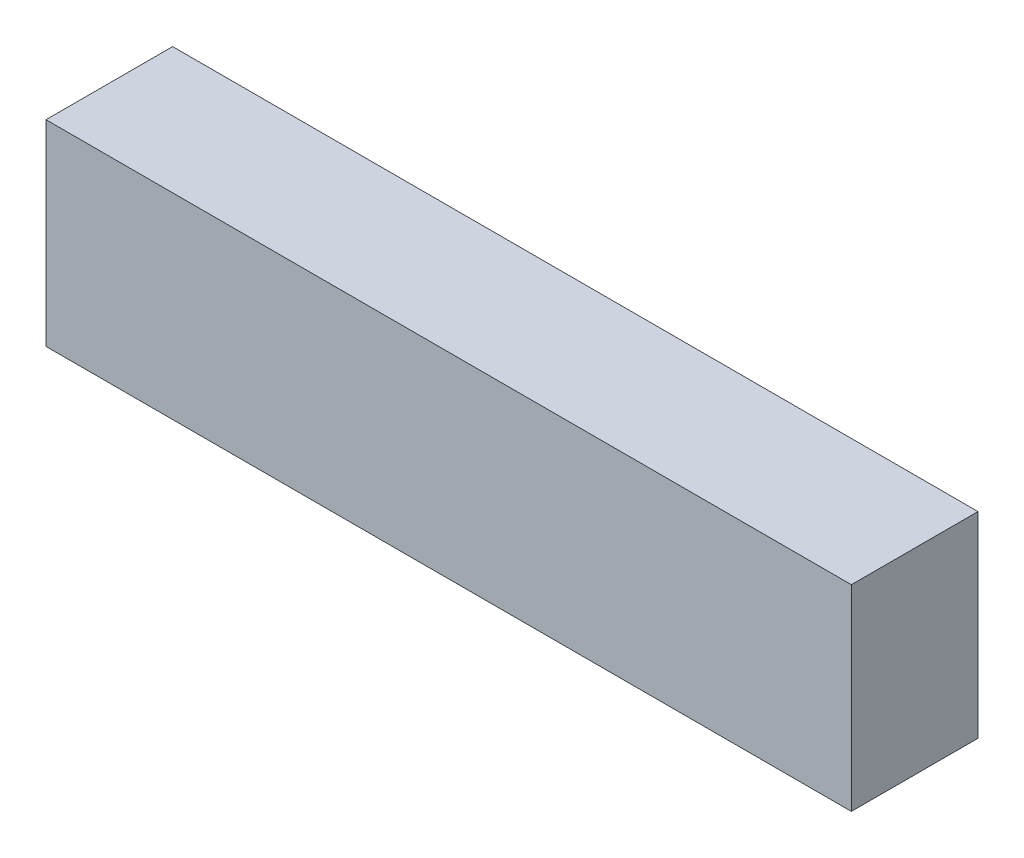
ISO-10303-21;
HEADER;
FILE_DESCRIPTION(('STEP AP214'),'2;1');
FILE_NAME('part.step','',(''),(''),'','','');
FILE_SCHEMA(('AUTOMOTIVE_DESIGN { 1 0 10303 214 1 1 1 1 }'));
ENDSEC;
DATA;
#1=APPLICATION_CONTEXT('core data for automotive mechanical design processes');
#2=APPLICATION_PROTOCOL_DEFINITION('international standard','automotive_design',2000,#1);
#3=PRODUCT_CONTEXT('',#1,'mechanical');
#4=PRODUCT('Part','Part','',(#3));
#5=PRODUCT_RELATED_PRODUCT_CATEGORY('part','',(#4));
#6=PRODUCT_DEFINITION_FORMATION('','',#4);
#7=PRODUCT_DEFINITION_CONTEXT('part definition',#1,'design');
#8=PRODUCT_DEFINITION('design','',#6,#7);
#9=PRODUCT_DEFINITION_SHAPE('','',#8);
#10=(LENGTH_UNIT() NAMED_UNIT(*) SI_UNIT(.MILLI.,.METRE.));
#11=(NAMED_UNIT(*) PLANE_ANGLE_UNIT() SI_UNIT($,.RADIAN.));
#12=(NAMED_UNIT(*) SI_UNIT($,.STERADIAN.) SOLID_ANGLE_UNIT());
#13=UNCERTAINTY_MEASURE_WITH_UNIT(LENGTH_MEASURE(1.E-05),#10,'distance_accuracy_value','');
#14=(GEOMETRIC_REPRESENTATION_CONTEXT(3) GLOBAL_UNCERTAINTY_ASSIGNED_CONTEXT((#13)) GLOBAL_UNIT_ASSIGNED_CONTEXT((#10,
#11,#12)) REPRESENTATION_CONTEXT('',''));
#15=CARTESIAN_POINT('',(0.,0.,0.));
#16=DIRECTION('',(0.,0.,1.));
#17=DIRECTION('',(1.,0.,0.));
#18=AXIS2_PLACEMENT_3D('',#15,#16,#17);
#19=CARTESIAN_POINT('',(30.,65.5056179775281,10.));
#20=DIRECTION('',(1.,0.,0.));
#21=DIRECTION('',(0.,1.,0.));
#22=AXIS2_PLACEMENT_3D('',#19,#20,#21);
#23=PLANE('',#22);
#24=DIRECTION('',(0.,-1.,0.));
#25=VECTOR('',#24,1.);
#26=CARTESIAN_POINT('',(30.,65.5056179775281,0.));
#27=LINE('',#26,#25);
#28=CARTESIAN_POINT('',(30.,65.5056179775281,0.));
#29=VERTEX_POINT('',#28);
#30=CARTESIAN_POINT('',(30.,50.,0.));
#31=VERTEX_POINT('',#30);
#32=EDGE_CURVE('E96',#29,#31,#27,.T.);
#33=ORIENTED_EDGE('',*,*,#32,.T.);
#34=DIRECTION('',(0.,0.,-1.));
#35=VECTOR('',#34,1.);
#36=CARTESIAN_POINT('',(30.,50.,10.));
#37=LINE('',#36,#35);
#38=CARTESIAN_POINT('',(30.,50.,10.));
#39=VERTEX_POINT('',#38);
#40=EDGE_CURVE('E11',#39,#31,#37,.T.);
#41=ORIENTED_EDGE('',*,*,#40,.F.);
#42=DIRECTION('',(0.,-1.,0.));
#43=VECTOR('',#42,1.);
#44=CARTESIAN_POINT('',(30.,65.5056179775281,10.));
#45=LINE('',#44,#43);
#46=CARTESIAN_POINT('',(30.,65.5056179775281,10.));
#47=VERTEX_POINT('',#46);
#48=EDGE_CURVE('E84',#47,#39,#45,.T.);
#49=ORIENTED_EDGE('',*,*,#48,.F.);
#50=DIRECTION('',(0.,0.,-1.));
#51=VECTOR('',#50,1.);
#52=CARTESIAN_POINT('',(30.,65.5056179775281,10.));
#53=LINE('',#52,#51);
#54=EDGE_CURVE('E92',#47,#29,#53,.T.);
#55=ORIENTED_EDGE('',*,*,#54,.T.);
#56=EDGE_LOOP('',(#33,#41,#49,#55));
#57=FACE_BOUND('',#56,.T.);
#58=ADVANCED_FACE('F33',(#57),#23,.F.);
#59=CARTESIAN_POINT('',(30.,50.,10.));
#60=DIRECTION('',(0.,1.,0.));
#61=DIRECTION('',(0.,0.,1.));
#62=AXIS2_PLACEMENT_3D('',#59,#60,#61);
#63=PLANE('',#62);
#64=DIRECTION('',(1.,0.,0.));
#65=VECTOR('',#64,1.);
#66=CARTESIAN_POINT('',(30.,50.,0.));
#67=LINE('',#66,#65);
#68=CARTESIAN_POINT('',(93.5955056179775,50.,0.));
#69=VERTEX_POINT('',#68);
#70=EDGE_CURVE('E88',#31,#69,#67,.T.);
#71=ORIENTED_EDGE('',*,*,#70,.T.);
#72=DIRECTION('',(0.,0.,-1.));
#73=VECTOR('',#72,1.);
#74=CARTESIAN_POINT('',(93.5955056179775,50.,10.));
#75=LINE('',#74,#73);
#76=CARTESIAN_POINT('',(93.5955056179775,50.,10.));
#77=VERTEX_POINT('',#76);
#78=EDGE_CURVE('E41',#77,#69,#75,.T.);
#79=ORIENTED_EDGE('',*,*,#78,.F.);
#80=DIRECTION('',(1.,0.,0.));
#81=VECTOR('',#80,1.);
#82=CARTESIAN_POINT('',(30.,50.,10.));
#83=LINE('',#82,#81);
#84=EDGE_CURVE('E79',#39,#77,#83,.T.);
#85=ORIENTED_EDGE('',*,*,#84,.F.);
#86=ORIENTED_EDGE('',*,*,#40,.T.);
#87=EDGE_LOOP('',(#71,#79,#85,#86));
#88=FACE_BOUND('',#87,.T.);
#89=ADVANCED_FACE('F87',(#88),#63,.F.);
#90=CARTESIAN_POINT('',(93.5955056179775,65.5056179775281,10.));
#91=DIRECTION('',(-1.,0.,0.));
#92=DIRECTION('',(0.,0.,1.));
#93=AXIS2_PLACEMENT_3D('',#90,#91,#92);
#94=PLANE('',#93);
#95=DIRECTION('',(0.,1.,0.));
#96=VECTOR('',#95,1.);
#97=CARTESIAN_POINT('',(93.5955056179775,65.5056179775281,0.));
#98=LINE('',#97,#96);
#99=CARTESIAN_POINT('',(93.5955056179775,65.5056179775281,0.));
#100=VERTEX_POINT('',#99);
#101=EDGE_CURVE('E66',#69,#100,#98,.T.);
#102=ORIENTED_EDGE('',*,*,#101,.T.);
#103=DIRECTION('',(0.,0.,-1.));
#104=VECTOR('',#103,1.);
#105=CARTESIAN_POINT('',(93.5955056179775,65.5056179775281,10.));
#106=LINE('',#105,#104);
#107=CARTESIAN_POINT('',(93.5955056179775,65.5056179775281,10.));
#108=VERTEX_POINT('',#107);
#109=EDGE_CURVE('E89',#108,#100,#106,.T.);
#110=ORIENTED_EDGE('',*,*,#109,.F.);
#111=DIRECTION('',(0.,1.,0.));
#112=VECTOR('',#111,1.);
#113=CARTESIAN_POINT('',(93.5955056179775,65.5056179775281,10.));
#114=LINE('',#113,#112);
#115=EDGE_CURVE('E82',#77,#108,#114,.T.);
#116=ORIENTED_EDGE('',*,*,#115,.F.);
#117=ORIENTED_EDGE('',*,*,#78,.T.);
#118=EDGE_LOOP('',(#102,#110,#116,#117));
#119=FACE_BOUND('',#118,.T.);
#120=ADVANCED_FACE('F90',(#119),#94,.F.);
#121=CARTESIAN_POINT('',(30.,65.5056179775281,10.));
#122=DIRECTION('',(0.,-1.,0.));
#123=DIRECTION('',(0.,0.,-1.));
#124=AXIS2_PLACEMENT_3D('',#121,#122,#123);
#125=PLANE('',#124);
#126=DIRECTION('',(-1.,0.,0.));
#127=VECTOR('',#126,1.);
#128=CARTESIAN_POINT('',(30.,65.5056179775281,0.));
#129=LINE('',#128,#127);
#130=EDGE_CURVE('E72',#100,#29,#129,.T.);
#131=ORIENTED_EDGE('',*,*,#130,.T.);
#132=ORIENTED_EDGE('',*,*,#54,.F.);
#133=DIRECTION('',(-1.,0.,0.));
#134=VECTOR('',#133,1.);
#135=CARTESIAN_POINT('',(30.,65.5056179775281,10.));
#136=LINE('',#135,#134);
#137=EDGE_CURVE('E49',#108,#47,#136,.T.);
#138=ORIENTED_EDGE('',*,*,#137,.F.);
#139=ORIENTED_EDGE('',*,*,#109,.T.);
#140=EDGE_LOOP('',(#131,#132,#138,#139));
#141=FACE_BOUND('',#140,.T.);
#142=ADVANCED_FACE('F103',(#141),#125,.F.);
#143=CARTESIAN_POINT('',(0.,0.,10.));
#144=DIRECTION('',(0.,0.,1.));
#145=DIRECTION('',(1.,0.,0.));
#146=AXIS2_PLACEMENT_3D('',#143,#144,#145);
#147=PLANE('',#146);
#148=ORIENTED_EDGE('',*,*,#48,.T.);
#149=ORIENTED_EDGE('',*,*,#84,.T.);
#150=ORIENTED_EDGE('',*,*,#115,.T.);
#151=ORIENTED_EDGE('',*,*,#137,.T.);
#152=EDGE_LOOP('',(#148,#149,#150,#151));
#153=FACE_BOUND('',#152,.T.);
#154=ADVANCED_FACE('F80',(#153),#147,.T.);
#155=CARTESIAN_POINT('',(0.,0.,0.));
#156=DIRECTION('',(0.,0.,1.));
#157=DIRECTION('',(1.,0.,0.));
#158=AXIS2_PLACEMENT_3D('',#155,#156,#157);
#159=PLANE('',#158);
#160=ORIENTED_EDGE('',*,*,#32,.F.);
#161=ORIENTED_EDGE('',*,*,#130,.F.);
#162=ORIENTED_EDGE('',*,*,#101,.F.);
#163=ORIENTED_EDGE('',*,*,#70,.F.);
#164=EDGE_LOOP('',(#160,#161,#162,#163));
#165=FACE_BOUND('',#164,.T.);
#166=ADVANCED_FACE('F106',(#165),#159,.F.);
#167=CLOSED_SHELL('',(#58,#89,#120,#142,#154,#166));
#168=MANIFOLD_SOLID_BREP('B2',#167);
#169=ADVANCED_BREP_SHAPE_REPRESENTATION('',(#18,#168),#14);
#170=SHAPE_DEFINITION_REPRESENTATION(#9,#169);
ENDSEC;
END-ISO-10303-21;
